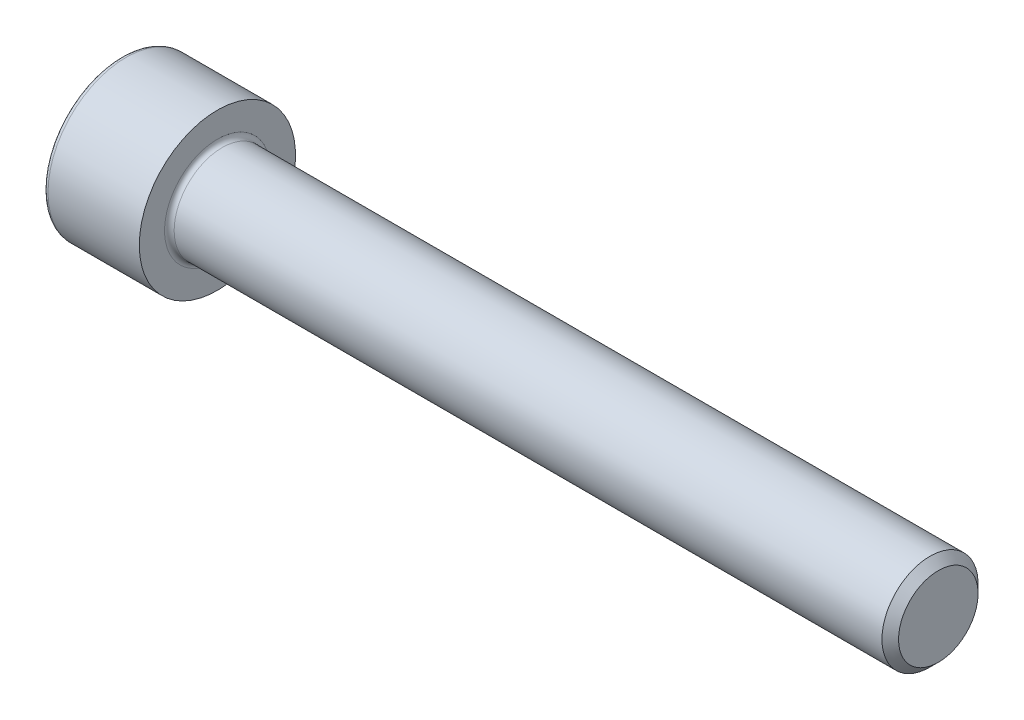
ISO-10303-21;
HEADER;
FILE_DESCRIPTION(('STEP AP214'),'2;1');
FILE_NAME('part.step','',(''),(''),'','','');
FILE_SCHEMA(('AUTOMOTIVE_DESIGN { 1 0 10303 214 1 1 1 1 }'));
ENDSEC;
DATA;
#1=APPLICATION_CONTEXT('core data for automotive mechanical design processes');
#2=APPLICATION_PROTOCOL_DEFINITION('international standard','automotive_design',2000,#1);
#3=PRODUCT_CONTEXT('',#1,'mechanical');
#4=PRODUCT('Part','Part','',(#3));
#5=PRODUCT_RELATED_PRODUCT_CATEGORY('part','',(#4));
#6=PRODUCT_DEFINITION_FORMATION('','',#4);
#7=PRODUCT_DEFINITION_CONTEXT('part definition',#1,'design');
#8=PRODUCT_DEFINITION('design','',#6,#7);
#9=PRODUCT_DEFINITION_SHAPE('','',#8);
#10=(LENGTH_UNIT() NAMED_UNIT(*) SI_UNIT(.MILLI.,.METRE.));
#11=(NAMED_UNIT(*) PLANE_ANGLE_UNIT() SI_UNIT($,.RADIAN.));
#12=(NAMED_UNIT(*) SI_UNIT($,.STERADIAN.) SOLID_ANGLE_UNIT());
#13=UNCERTAINTY_MEASURE_WITH_UNIT(LENGTH_MEASURE(1.E-05),#10,'distance_accuracy_value','');
#14=(GEOMETRIC_REPRESENTATION_CONTEXT(3) GLOBAL_UNCERTAINTY_ASSIGNED_CONTEXT((#13)) GLOBAL_UNIT_ASSIGNED_CONTEXT((#10,
#11,#12)) REPRESENTATION_CONTEXT('',''));
#15=CARTESIAN_POINT('',(0.,0.,0.));
#16=DIRECTION('',(0.,0.,1.));
#17=DIRECTION('',(1.,0.,0.));
#18=AXIS2_PLACEMENT_3D('',#15,#16,#17);
#19=CARTESIAN_POINT('',(0.,0.,0.));
#20=DIRECTION('',(-1.,0.,0.));
#21=DIRECTION('',(0.,0.,1.));
#22=AXIS2_PLACEMENT_3D('',#19,#20,#21);
#23=PLANE('',#22);
#24=DIRECTION('',(0.,-0.499999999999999,0.866025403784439));
#25=VECTOR('',#24,1.);
#26=CARTESIAN_POINT('',(0.,3.51894989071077,0.));
#27=LINE('',#26,#25);
#28=CARTESIAN_POINT('',(0.,3.51894989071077,0.));
#29=VERTEX_POINT('',#28);
#30=CARTESIAN_POINT('',(0.,1.75947494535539,3.04749999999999));
#31=VERTEX_POINT('',#30);
#32=EDGE_CURVE('E256',#29,#31,#27,.T.);
#33=ORIENTED_EDGE('',*,*,#32,.T.);
#34=DIRECTION('',(0.,1.,0.));
#35=VECTOR('',#34,1.);
#36=CARTESIAN_POINT('',(0.,-1.75947494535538,3.0475));
#37=LINE('',#36,#35);
#38=CARTESIAN_POINT('',(0.,-1.75947494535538,3.0475));
#39=VERTEX_POINT('',#38);
#40=EDGE_CURVE('E128',#39,#31,#37,.T.);
#41=ORIENTED_EDGE('',*,*,#40,.F.);
#42=DIRECTION('',(0.,-0.500000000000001,-0.866025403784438));
#43=VECTOR('',#42,1.);
#44=CARTESIAN_POINT('',(0.,-1.75947494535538,3.0475));
#45=LINE('',#44,#43);
#46=CARTESIAN_POINT('',(0.,-3.51894989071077,0.));
#47=VERTEX_POINT('',#46);
#48=EDGE_CURVE('E259',#39,#47,#45,.T.);
#49=ORIENTED_EDGE('',*,*,#48,.T.);
#50=DIRECTION('',(0.,0.499999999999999,-0.866025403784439));
#51=VECTOR('',#50,1.);
#52=CARTESIAN_POINT('',(0.,-3.51894989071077,0.));
#53=LINE('',#52,#51);
#54=CARTESIAN_POINT('',(0.,-1.75947494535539,-3.0475));
#55=VERTEX_POINT('',#54);
#56=EDGE_CURVE('E262',#47,#55,#53,.T.);
#57=ORIENTED_EDGE('',*,*,#56,.T.);
#58=DIRECTION('',(0.,-1.,0.));
#59=VECTOR('',#58,1.);
#60=CARTESIAN_POINT('',(0.,1.75947494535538,-3.04750000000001));
#61=LINE('',#60,#59);
#62=CARTESIAN_POINT('',(0.,1.75947494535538,-3.04750000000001));
#63=VERTEX_POINT('',#62);
#64=EDGE_CURVE('E265',#63,#55,#61,.T.);
#65=ORIENTED_EDGE('',*,*,#64,.F.);
#66=DIRECTION('',(0.,-0.500000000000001,-0.866025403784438));
#67=VECTOR('',#66,1.);
#68=CARTESIAN_POINT('',(0.,3.51894989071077,0.));
#69=LINE('',#68,#67);
#70=EDGE_CURVE('E123',#29,#63,#69,.T.);
#71=ORIENTED_EDGE('',*,*,#70,.F.);
#72=EDGE_LOOP('',(#33,#41,#49,#57,#65,#71));
#73=FACE_BOUND('',#72,.T.);
#74=CARTESIAN_POINT('',(0.,0.,0.));
#75=DIRECTION('',(-1.,0.,0.));
#76=DIRECTION('',(0.,0.,1.));
#77=AXIS2_PLACEMENT_3D('',#74,#75,#76);
#78=CIRCLE('',#77,6.1);
#79=CARTESIAN_POINT('',(0.,0.,6.1));
#80=VERTEX_POINT('',#79);
#81=EDGE_CURVE('E40',#80,#80,#78,.T.);
#82=ORIENTED_EDGE('',*,*,#81,.T.);
#83=EDGE_LOOP('',(#82));
#84=FACE_BOUND('',#83,.T.);
#85=ADVANCED_FACE('F32',(#73,#84),#23,.T.);
#86=CARTESIAN_POINT('',(-31.75,0.,0.));
#87=DIRECTION('',(-1.,0.,0.));
#88=DIRECTION('',(0.,0.,1.));
#89=AXIS2_PLACEMENT_3D('',#86,#87,#88);
#90=CYLINDRICAL_SURFACE('',#89,6.5);
#91=CARTESIAN_POINT('',(0.399999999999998,0.,0.));
#92=DIRECTION('',(-1.,0.,0.));
#93=DIRECTION('',(0.,0.,1.));
#94=AXIS2_PLACEMENT_3D('',#91,#92,#93);
#95=CIRCLE('',#94,6.5);
#96=CARTESIAN_POINT('',(0.399999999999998,0.,6.5));
#97=VERTEX_POINT('',#96);
#98=EDGE_CURVE('E11',#97,#97,#95,.F.);
#99=ORIENTED_EDGE('',*,*,#98,.T.);
#100=EDGE_LOOP('',(#99));
#101=FACE_BOUND('',#100,.T.);
#102=CARTESIAN_POINT('',(8.00000000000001,0.,0.));
#103=DIRECTION('',(-1.,0.,0.));
#104=DIRECTION('',(0.,0.,1.));
#105=AXIS2_PLACEMENT_3D('',#102,#103,#104);
#106=CIRCLE('',#105,6.5);
#107=CARTESIAN_POINT('',(8.00000000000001,0.,6.5));
#108=VERTEX_POINT('',#107);
#109=EDGE_CURVE('E146',#108,#108,#106,.T.);
#110=ORIENTED_EDGE('',*,*,#109,.T.);
#111=EDGE_LOOP('',(#110));
#112=FACE_BOUND('',#111,.T.);
#113=ADVANCED_FACE('F170',(#101,#112),#90,.T.);
#114=CARTESIAN_POINT('',(8.,6.5,0.));
#115=DIRECTION('',(1.,0.,0.));
#116=DIRECTION('',(0.,0.,-1.));
#117=AXIS2_PLACEMENT_3D('',#114,#115,#116);
#118=PLANE('',#117);
#119=CARTESIAN_POINT('',(8.,0.,0.));
#120=DIRECTION('',(1.,0.,0.));
#121=DIRECTION('',(0.,0.,-1.));
#122=AXIS2_PLACEMENT_3D('',#119,#120,#121);
#123=CIRCLE('',#122,4.4);
#124=CARTESIAN_POINT('',(8.,0.,-4.4));
#125=VERTEX_POINT('',#124);
#126=EDGE_CURVE('E149',#125,#125,#123,.F.);
#127=ORIENTED_EDGE('',*,*,#126,.T.);
#128=EDGE_LOOP('',(#127));
#129=FACE_BOUND('',#128,.T.);
#130=ORIENTED_EDGE('',*,*,#109,.F.);
#131=EDGE_LOOP('',(#130));
#132=FACE_BOUND('',#131,.T.);
#133=ADVANCED_FACE('F176',(#129,#132),#118,.T.);
#134=CARTESIAN_POINT('',(-31.75,0.,0.));
#135=DIRECTION('',(-1.,0.,0.));
#136=DIRECTION('',(0.,0.,1.));
#137=AXIS2_PLACEMENT_3D('',#134,#135,#136);
#138=CYLINDRICAL_SURFACE('',#137,4.);
#139=CARTESIAN_POINT('',(8.4,0.,0.));
#140=DIRECTION('',(1.,0.,0.));
#141=DIRECTION('',(0.,0.,-1.));
#142=AXIS2_PLACEMENT_3D('',#139,#140,#141);
#143=CIRCLE('',#142,4.);
#144=CARTESIAN_POINT('',(8.4,0.,-4.));
#145=VERTEX_POINT('',#144);
#146=EDGE_CURVE('E152',#145,#145,#143,.T.);
#147=ORIENTED_EDGE('',*,*,#146,.T.);
#148=EDGE_LOOP('',(#147));
#149=FACE_BOUND('',#148,.T.);
#150=CARTESIAN_POINT('',(67.3095,0.,0.));
#151=DIRECTION('',(-1.,0.,0.));
#152=DIRECTION('',(0.,0.,1.));
#153=AXIS2_PLACEMENT_3D('',#150,#151,#152);
#154=CIRCLE('',#153,4.);
#155=CARTESIAN_POINT('',(67.3095,0.,4.));
#156=VERTEX_POINT('',#155);
#157=EDGE_CURVE('E143',#156,#156,#154,.T.);
#158=ORIENTED_EDGE('',*,*,#157,.T.);
#159=EDGE_LOOP('',(#158));
#160=FACE_BOUND('',#159,.T.);
#161=ADVANCED_FACE('F182',(#149,#160),#138,.T.);
#162=CARTESIAN_POINT('',(68.,0.,0.));
#163=DIRECTION('',(-1.,0.,0.));
#164=DIRECTION('',(0.,0.,1.));
#165=AXIS2_PLACEMENT_3D('',#162,#163,#164);
#166=CONICAL_SURFACE('',#165,3.3095,0.785398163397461);
#167=ORIENTED_EDGE('',*,*,#157,.F.);
#168=EDGE_LOOP('',(#167));
#169=FACE_BOUND('',#168,.T.);
#170=CARTESIAN_POINT('',(68.,0.,0.));
#171=DIRECTION('',(-1.,0.,0.));
#172=DIRECTION('',(0.,0.,1.));
#173=AXIS2_PLACEMENT_3D('',#170,#171,#172);
#174=CIRCLE('',#173,3.3095);
#175=CARTESIAN_POINT('',(68.,0.,3.3095));
#176=VERTEX_POINT('',#175);
#177=EDGE_CURVE('E139',#176,#176,#174,.T.);
#178=ORIENTED_EDGE('',*,*,#177,.T.);
#179=EDGE_LOOP('',(#178));
#180=FACE_BOUND('',#179,.T.);
#181=ADVANCED_FACE('F186',(#169,#180),#166,.T.);
#182=CARTESIAN_POINT('',(68.,3.3095,0.));
#183=DIRECTION('',(1.,0.,0.));
#184=DIRECTION('',(0.,0.,-1.));
#185=AXIS2_PLACEMENT_3D('',#182,#183,#184);
#186=PLANE('',#185);
#187=ORIENTED_EDGE('',*,*,#177,.F.);
#188=EDGE_LOOP('',(#187));
#189=FACE_BOUND('',#188,.T.);
#190=ADVANCED_FACE('F166',(#189),#186,.T.);
#191=CARTESIAN_POINT('',(8.4,0.,0.));
#192=DIRECTION('',(1.,0.,0.));
#193=DIRECTION('',(0.,0.,-1.));
#194=AXIS2_PLACEMENT_3D('',#191,#192,#193);
#195=TOROIDAL_SURFACE('',#194,4.4,0.4);
#196=ORIENTED_EDGE('',*,*,#146,.F.);
#197=EDGE_LOOP('',(#196));
#198=FACE_BOUND('',#197,.T.);
#199=ORIENTED_EDGE('',*,*,#126,.F.);
#200=EDGE_LOOP('',(#199));
#201=FACE_BOUND('',#200,.T.);
#202=ADVANCED_FACE('F159',(#198,#201),#195,.F.);
#203=CARTESIAN_POINT('',(0.399999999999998,0.,0.));
#204=DIRECTION('',(-1.,0.,0.));
#205=DIRECTION('',(0.,0.,1.));
#206=AXIS2_PLACEMENT_3D('',#203,#204,#205);
#207=TOROIDAL_SURFACE('',#206,6.1,0.4);
#208=ORIENTED_EDGE('',*,*,#98,.F.);
#209=EDGE_LOOP('',(#208));
#210=FACE_BOUND('',#209,.T.);
#211=ORIENTED_EDGE('',*,*,#81,.F.);
#212=EDGE_LOOP('',(#211));
#213=FACE_BOUND('',#212,.T.);
#214=ADVANCED_FACE('F34',(#210,#213),#207,.T.);
#215=CARTESIAN_POINT('',(4.,3.51894989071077,0.));
#216=DIRECTION('',(0.,-0.866025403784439,-0.499999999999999));
#217=DIRECTION('',(0.,0.499999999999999,-0.866025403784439));
#218=AXIS2_PLACEMENT_3D('',#215,#216,#217);
#219=PLANE('',#218);
#220=ORIENTED_EDGE('',*,*,#32,.F.);
#221=DIRECTION('',(-1.,0.,0.));
#222=VECTOR('',#221,1.);
#223=CARTESIAN_POINT('',(4.,3.51894989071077,0.));
#224=LINE('',#223,#222);
#225=CARTESIAN_POINT('',(4.,3.51894989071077,0.));
#226=VERTEX_POINT('',#225);
#227=EDGE_CURVE('E246',#226,#29,#224,.T.);
#228=ORIENTED_EDGE('',*,*,#227,.F.);
#229=DIRECTION('',(0.,-0.499999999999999,0.866025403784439));
#230=VECTOR('',#229,1.);
#231=CARTESIAN_POINT('',(4.,3.51894989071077,0.));
#232=LINE('',#231,#230);
#233=CARTESIAN_POINT('',(4.,2.63921241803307,1.52374999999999));
#234=VERTEX_POINT('',#233);
#235=EDGE_CURVE('E115',#226,#234,#232,.T.);
#236=ORIENTED_EDGE('',*,*,#235,.T.);
#237=CARTESIAN_POINT('',(4.,1.75947494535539,3.04749999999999));
#238=VERTEX_POINT('',#237);
#239=EDGE_CURVE('E106',#234,#238,#232,.T.);
#240=ORIENTED_EDGE('',*,*,#239,.T.);
#241=DIRECTION('',(-1.,0.,0.));
#242=VECTOR('',#241,1.);
#243=CARTESIAN_POINT('',(4.,1.75947494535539,3.04749999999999));
#244=LINE('',#243,#242);
#245=EDGE_CURVE('E120',#238,#31,#244,.T.);
#246=ORIENTED_EDGE('',*,*,#245,.T.);
#247=EDGE_LOOP('',(#220,#228,#236,#240,#246));
#248=FACE_BOUND('',#247,.T.);
#249=ADVANCED_FACE('F119',(#248),#219,.T.);
#250=CARTESIAN_POINT('',(4.,-1.75947494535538,3.0475));
#251=DIRECTION('',(0.,0.,1.));
#252=DIRECTION('',(0.,-1.,0.));
#253=AXIS2_PLACEMENT_3D('',#250,#251,#252);
#254=PLANE('',#253);
#255=ORIENTED_EDGE('',*,*,#40,.T.);
#256=ORIENTED_EDGE('',*,*,#245,.F.);
#257=DIRECTION('',(0.,1.,0.));
#258=VECTOR('',#257,1.);
#259=CARTESIAN_POINT('',(4.,-1.75947494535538,3.0475));
#260=LINE('',#259,#258);
#261=CARTESIAN_POINT('',(4.,0.,3.0475));
#262=VERTEX_POINT('',#261);
#263=EDGE_CURVE('E103',#262,#238,#260,.T.);
#264=ORIENTED_EDGE('',*,*,#263,.F.);
#265=CARTESIAN_POINT('',(4.,-1.75947494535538,3.0475));
#266=VERTEX_POINT('',#265);
#267=EDGE_CURVE('E114',#266,#262,#260,.T.);
#268=ORIENTED_EDGE('',*,*,#267,.F.);
#269=DIRECTION('',(-1.,0.,0.));
#270=VECTOR('',#269,1.);
#271=CARTESIAN_POINT('',(4.,-1.75947494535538,3.0475));
#272=LINE('',#271,#270);
#273=EDGE_CURVE('E130',#266,#39,#272,.T.);
#274=ORIENTED_EDGE('',*,*,#273,.T.);
#275=EDGE_LOOP('',(#255,#256,#264,#268,#274));
#276=FACE_BOUND('',#275,.T.);
#277=ADVANCED_FACE('F125',(#276),#254,.F.);
#278=CARTESIAN_POINT('',(4.,-1.75947494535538,3.0475));
#279=DIRECTION('',(0.,0.866025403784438,-0.500000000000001));
#280=DIRECTION('',(0.,0.500000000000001,0.866025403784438));
#281=AXIS2_PLACEMENT_3D('',#278,#279,#280);
#282=PLANE('',#281);
#283=ORIENTED_EDGE('',*,*,#48,.F.);
#284=ORIENTED_EDGE('',*,*,#273,.F.);
#285=DIRECTION('',(0.,-0.500000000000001,-0.866025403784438));
#286=VECTOR('',#285,1.);
#287=CARTESIAN_POINT('',(4.,-1.75947494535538,3.0475));
#288=LINE('',#287,#286);
#289=CARTESIAN_POINT('',(4.,-2.63921241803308,1.52375));
#290=VERTEX_POINT('',#289);
#291=EDGE_CURVE('E285',#266,#290,#288,.T.);
#292=ORIENTED_EDGE('',*,*,#291,.T.);
#293=CARTESIAN_POINT('',(4.,-3.51894989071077,0.));
#294=VERTEX_POINT('',#293);
#295=EDGE_CURVE('E274',#290,#294,#288,.T.);
#296=ORIENTED_EDGE('',*,*,#295,.T.);
#297=DIRECTION('',(-1.,0.,0.));
#298=VECTOR('',#297,1.);
#299=CARTESIAN_POINT('',(4.,-3.51894989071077,0.));
#300=LINE('',#299,#298);
#301=EDGE_CURVE('E135',#294,#47,#300,.T.);
#302=ORIENTED_EDGE('',*,*,#301,.T.);
#303=EDGE_LOOP('',(#283,#284,#292,#296,#302));
#304=FACE_BOUND('',#303,.T.);
#305=ADVANCED_FACE('F200',(#304),#282,.T.);
#306=CARTESIAN_POINT('',(4.,-3.51894989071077,0.));
#307=DIRECTION('',(0.,0.866025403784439,0.499999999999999));
#308=DIRECTION('',(0.,-0.499999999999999,0.866025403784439));
#309=AXIS2_PLACEMENT_3D('',#306,#307,#308);
#310=PLANE('',#309);
#311=ORIENTED_EDGE('',*,*,#56,.F.);
#312=ORIENTED_EDGE('',*,*,#301,.F.);
#313=DIRECTION('',(0.,0.499999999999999,-0.866025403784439));
#314=VECTOR('',#313,1.);
#315=CARTESIAN_POINT('',(4.,-3.51894989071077,0.));
#316=LINE('',#315,#314);
#317=CARTESIAN_POINT('',(4.,-2.63921241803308,-1.52375));
#318=VERTEX_POINT('',#317);
#319=EDGE_CURVE('E252',#294,#318,#316,.T.);
#320=ORIENTED_EDGE('',*,*,#319,.T.);
#321=CARTESIAN_POINT('',(4.,-1.75947494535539,-3.0475));
#322=VERTEX_POINT('',#321);
#323=EDGE_CURVE('E284',#318,#322,#316,.T.);
#324=ORIENTED_EDGE('',*,*,#323,.T.);
#325=DIRECTION('',(-1.,0.,0.));
#326=VECTOR('',#325,1.);
#327=CARTESIAN_POINT('',(4.,-1.75947494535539,-3.0475));
#328=LINE('',#327,#326);
#329=EDGE_CURVE('E245',#322,#55,#328,.T.);
#330=ORIENTED_EDGE('',*,*,#329,.T.);
#331=EDGE_LOOP('',(#311,#312,#320,#324,#330));
#332=FACE_BOUND('',#331,.T.);
#333=ADVANCED_FACE('F203',(#332),#310,.T.);
#334=CARTESIAN_POINT('',(4.,1.75947494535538,-3.04750000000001));
#335=DIRECTION('',(0.,0.,-1.));
#336=DIRECTION('',(0.,1.,0.));
#337=AXIS2_PLACEMENT_3D('',#334,#335,#336);
#338=PLANE('',#337);
#339=ORIENTED_EDGE('',*,*,#64,.T.);
#340=ORIENTED_EDGE('',*,*,#329,.F.);
#341=DIRECTION('',(0.,-1.,0.));
#342=VECTOR('',#341,1.);
#343=CARTESIAN_POINT('',(4.,1.75947494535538,-3.04750000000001));
#344=LINE('',#343,#342);
#345=CARTESIAN_POINT('',(4.,0.,-3.0475));
#346=VERTEX_POINT('',#345);
#347=EDGE_CURVE('E249',#346,#322,#344,.T.);
#348=ORIENTED_EDGE('',*,*,#347,.F.);
#349=CARTESIAN_POINT('',(4.,1.75947494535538,-3.04750000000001));
#350=VERTEX_POINT('',#349);
#351=EDGE_CURVE('E47',#350,#346,#344,.T.);
#352=ORIENTED_EDGE('',*,*,#351,.F.);
#353=DIRECTION('',(-1.,0.,0.));
#354=VECTOR('',#353,1.);
#355=CARTESIAN_POINT('',(4.,1.75947494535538,-3.04750000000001));
#356=LINE('',#355,#354);
#357=EDGE_CURVE('E242',#350,#63,#356,.T.);
#358=ORIENTED_EDGE('',*,*,#357,.T.);
#359=EDGE_LOOP('',(#339,#340,#348,#352,#358));
#360=FACE_BOUND('',#359,.T.);
#361=ADVANCED_FACE('F207',(#360),#338,.F.);
#362=CARTESIAN_POINT('',(4.,3.51894989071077,0.));
#363=DIRECTION('',(0.,0.866025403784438,-0.500000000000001));
#364=DIRECTION('',(0.,0.500000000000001,0.866025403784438));
#365=AXIS2_PLACEMENT_3D('',#362,#363,#364);
#366=PLANE('',#365);
#367=ORIENTED_EDGE('',*,*,#70,.T.);
#368=ORIENTED_EDGE('',*,*,#357,.F.);
#369=DIRECTION('',(0.,-0.500000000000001,-0.866025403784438));
#370=VECTOR('',#369,1.);
#371=CARTESIAN_POINT('',(4.,3.51894989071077,0.));
#372=LINE('',#371,#370);
#373=CARTESIAN_POINT('',(4.,2.63921241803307,-1.52375));
#374=VERTEX_POINT('',#373);
#375=EDGE_CURVE('E232',#374,#350,#372,.T.);
#376=ORIENTED_EDGE('',*,*,#375,.F.);
#377=EDGE_CURVE('E238',#226,#374,#372,.T.);
#378=ORIENTED_EDGE('',*,*,#377,.F.);
#379=ORIENTED_EDGE('',*,*,#227,.T.);
#380=EDGE_LOOP('',(#367,#368,#376,#378,#379));
#381=FACE_BOUND('',#380,.T.);
#382=ADVANCED_FACE('F211',(#381),#366,.F.);
#383=CARTESIAN_POINT('',(4.,5.27842483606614,-3.04750000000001));
#384=DIRECTION('',(1.,0.,0.));
#385=DIRECTION('',(0.,0.,-1.));
#386=AXIS2_PLACEMENT_3D('',#383,#384,#385);
#387=PLANE('',#386);
#388=ORIENTED_EDGE('',*,*,#347,.T.);
#389=ORIENTED_EDGE('',*,*,#323,.F.);
#390=CARTESIAN_POINT('',(4.,0.,0.));
#391=DIRECTION('',(-1.,0.,0.));
#392=DIRECTION('',(0.,0.,1.));
#393=AXIS2_PLACEMENT_3D('',#390,#391,#392);
#394=CIRCLE('',#393,3.0475);
#395=EDGE_CURVE('E280',#346,#318,#394,.T.);
#396=ORIENTED_EDGE('',*,*,#395,.F.);
#397=EDGE_LOOP('',(#388,#389,#396));
#398=FACE_BOUND('',#397,.T.);
#399=ADVANCED_FACE('F215',(#398),#387,.F.);
#400=ORIENTED_EDGE('',*,*,#319,.F.);
#401=ORIENTED_EDGE('',*,*,#295,.F.);
#402=EDGE_CURVE('E133',#318,#290,#394,.T.);
#403=ORIENTED_EDGE('',*,*,#402,.F.);
#404=EDGE_LOOP('',(#400,#401,#403));
#405=FACE_BOUND('',#404,.T.);
#406=ADVANCED_FACE('F218',(#405),#387,.F.);
#407=ORIENTED_EDGE('',*,*,#291,.F.);
#408=ORIENTED_EDGE('',*,*,#267,.T.);
#409=EDGE_CURVE('E129',#290,#262,#394,.T.);
#410=ORIENTED_EDGE('',*,*,#409,.F.);
#411=EDGE_LOOP('',(#407,#408,#410));
#412=FACE_BOUND('',#411,.T.);
#413=ADVANCED_FACE('F223',(#412),#387,.F.);
#414=ORIENTED_EDGE('',*,*,#263,.T.);
#415=ORIENTED_EDGE('',*,*,#239,.F.);
#416=EDGE_CURVE('E109',#262,#234,#394,.T.);
#417=ORIENTED_EDGE('',*,*,#416,.F.);
#418=EDGE_LOOP('',(#414,#415,#417));
#419=FACE_BOUND('',#418,.T.);
#420=ADVANCED_FACE('F105',(#419),#387,.F.);
#421=ORIENTED_EDGE('',*,*,#235,.F.);
#422=ORIENTED_EDGE('',*,*,#377,.T.);
#423=EDGE_CURVE('E140',#234,#374,#394,.T.);
#424=ORIENTED_EDGE('',*,*,#423,.F.);
#425=EDGE_LOOP('',(#421,#422,#424));
#426=FACE_BOUND('',#425,.T.);
#427=ADVANCED_FACE('F226',(#426),#387,.F.);
#428=ORIENTED_EDGE('',*,*,#375,.T.);
#429=ORIENTED_EDGE('',*,*,#351,.T.);
#430=EDGE_CURVE('E235',#374,#346,#394,.T.);
#431=ORIENTED_EDGE('',*,*,#430,.F.);
#432=EDGE_LOOP('',(#428,#429,#431));
#433=FACE_BOUND('',#432,.T.);
#434=ADVANCED_FACE('F196',(#433),#387,.F.);
#435=CARTESIAN_POINT('',(4.,0.,0.));
#436=DIRECTION('',(-1.,0.,0.));
#437=DIRECTION('',(0.,0.,1.));
#438=AXIS2_PLACEMENT_3D('',#435,#436,#437);
#439=CONICAL_SURFACE('',#438,3.0475,1.04719755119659);
#440=CARTESIAN_POINT('',(5.75947494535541,0.,0.));
#441=VERTEX_POINT('',#440);
#442=VERTEX_LOOP('',#441);
#443=FACE_BOUND('',#442,.T.);
#444=ORIENTED_EDGE('',*,*,#416,.T.);
#445=ORIENTED_EDGE('',*,*,#423,.T.);
#446=ORIENTED_EDGE('',*,*,#430,.T.);
#447=ORIENTED_EDGE('',*,*,#395,.T.);
#448=ORIENTED_EDGE('',*,*,#402,.T.);
#449=ORIENTED_EDGE('',*,*,#409,.T.);
#450=EDGE_LOOP('',(#444,#445,#446,#447,#448,#449));
#451=FACE_BOUND('',#450,.T.);
#452=ADVANCED_FACE('F194',(#443,#451),#439,.F.);
#453=CLOSED_SHELL('',(#85,#113,#133,#161,#181,#190,#202,#214,#249,#277,#305,#333,#361,#382,#399,
#406,#413,#420,#427,#434,#452));
#454=MANIFOLD_SOLID_BREP('B2',#453);
#455=ADVANCED_BREP_SHAPE_REPRESENTATION('',(#18,#454),#14);
#456=SHAPE_DEFINITION_REPRESENTATION(#9,#455);
ENDSEC;
END-ISO-10303-21;
